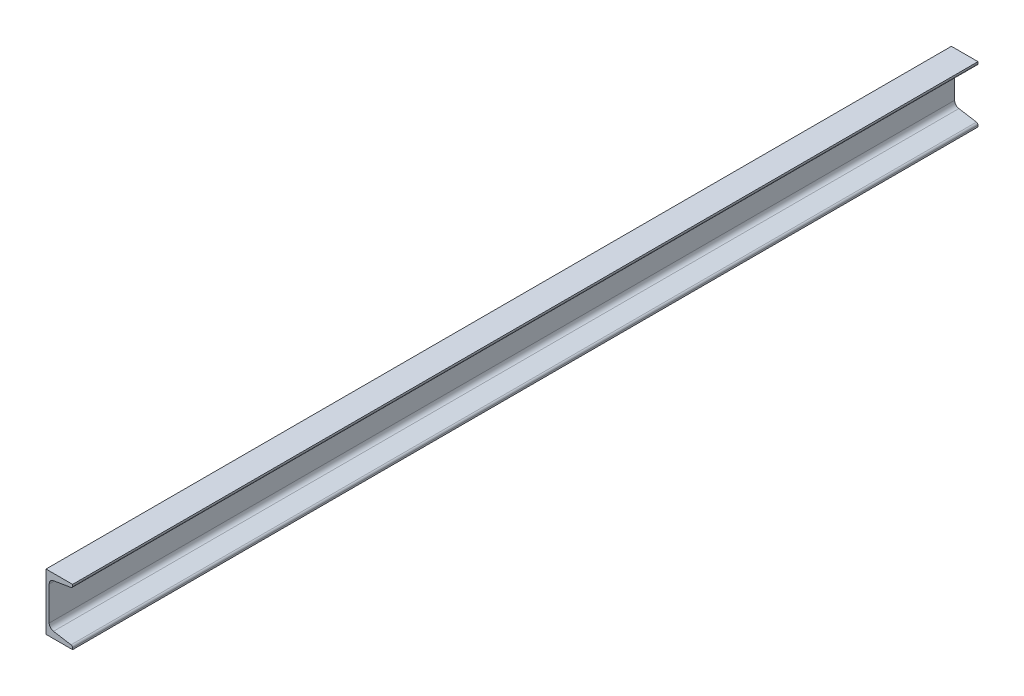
from build123d import *

# Parameters (mm, degrees)
BASECHANNEL_DEPTH = 609.6


with BuildPart() as part:
    # Sketch1 → BaseChannel (new, symmetric)
    with BuildSketch(Plane.XY):
        with BuildLine():
            Line((0, 0), (0, 76.2))
            Line((0, 76.2), (35.814, 76.2))
            Line((35.814, 76.2), (35.814, 74.042335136))
            ThreePointArc((35.814, 74.042335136), (35.212080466, 72.400554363), (33.691603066, 71.536899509))
            Line((33.691603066, 71.536899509), (10.048471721, 67.596090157))
            ThreePointArc((10.048471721, 67.596090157), (5.943182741, 65.264222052), (4.318, 60.831413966))
            Line((4.318, 60.831413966), (4.318, 15.368586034))
            ThreePointArc((4.318, 15.368586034), (5.943182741, 10.935777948), (10.048471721, 8.603909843))
            Line((10.048471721, 8.603909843), (33.691603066, 4.663100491))
            ThreePointArc((33.691603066, 4.663100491), (35.212080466, 3.799445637), (35.814, 2.157664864))
            Line((35.814, 2.157664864), (35.814, 0))
            Line((35.814, 0), (0, 0))
        make_face()
    extrude(amount=BASECHANNEL_DEPTH, both=True)


solid = part.part
